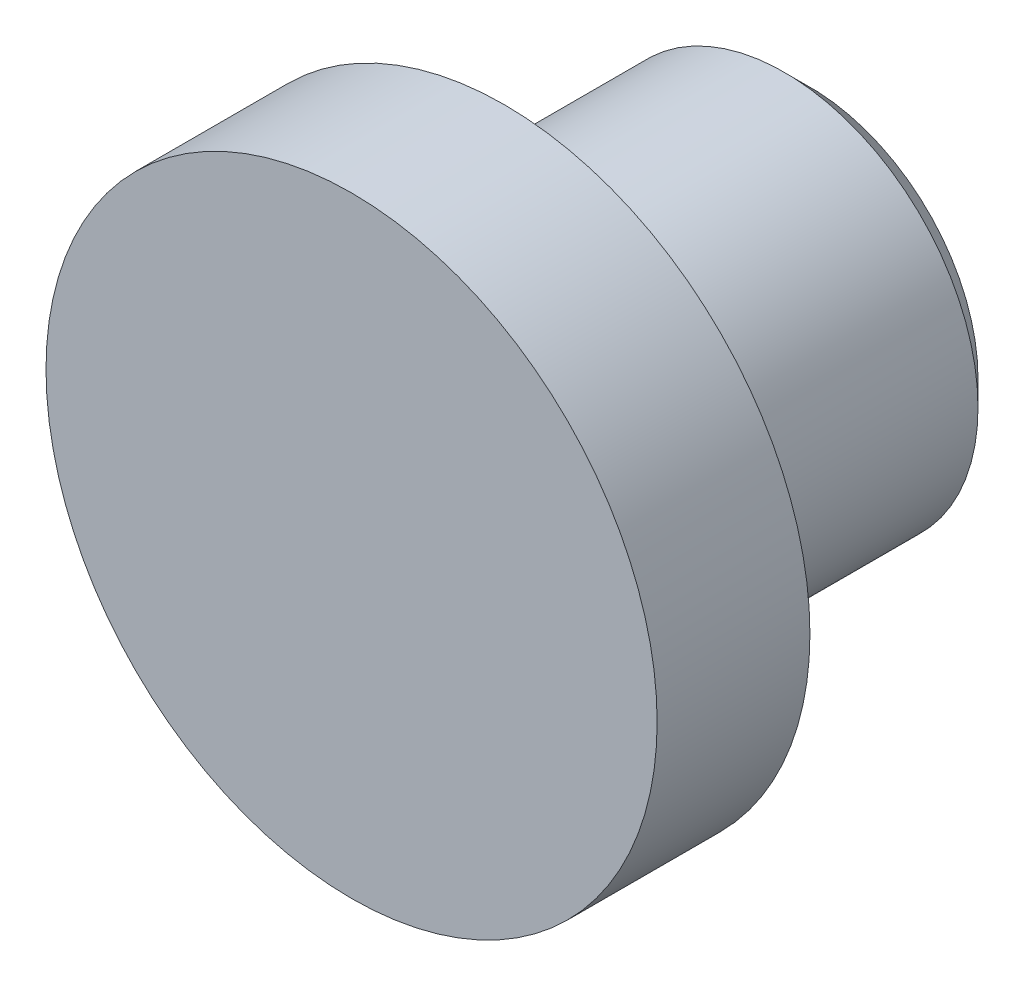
ISO-10303-21;
HEADER;
FILE_DESCRIPTION(('STEP AP214'),'2;1');
FILE_NAME('part.step','',(''),(''),'','','');
FILE_SCHEMA(('AUTOMOTIVE_DESIGN { 1 0 10303 214 1 1 1 1 }'));
ENDSEC;
DATA;
#1=APPLICATION_CONTEXT('core data for automotive mechanical design processes');
#2=APPLICATION_PROTOCOL_DEFINITION('international standard','automotive_design',2000,#1);
#3=PRODUCT_CONTEXT('',#1,'mechanical');
#4=PRODUCT('Part','Part','',(#3));
#5=PRODUCT_RELATED_PRODUCT_CATEGORY('part','',(#4));
#6=PRODUCT_DEFINITION_FORMATION('','',#4);
#7=PRODUCT_DEFINITION_CONTEXT('part definition',#1,'design');
#8=PRODUCT_DEFINITION('design','',#6,#7);
#9=PRODUCT_DEFINITION_SHAPE('','',#8);
#10=(LENGTH_UNIT() NAMED_UNIT(*) SI_UNIT(.MILLI.,.METRE.));
#11=(NAMED_UNIT(*) PLANE_ANGLE_UNIT() SI_UNIT($,.RADIAN.));
#12=(NAMED_UNIT(*) SI_UNIT($,.STERADIAN.) SOLID_ANGLE_UNIT());
#13=UNCERTAINTY_MEASURE_WITH_UNIT(LENGTH_MEASURE(1.E-05),#10,'distance_accuracy_value','');
#14=(GEOMETRIC_REPRESENTATION_CONTEXT(3) GLOBAL_UNCERTAINTY_ASSIGNED_CONTEXT((#13)) GLOBAL_UNIT_ASSIGNED_CONTEXT((#10,
#11,#12)) REPRESENTATION_CONTEXT('',''));
#15=CARTESIAN_POINT('',(0.,0.,0.));
#16=DIRECTION('',(0.,0.,1.));
#17=DIRECTION('',(1.,0.,0.));
#18=AXIS2_PLACEMENT_3D('',#15,#16,#17);
#19=CARTESIAN_POINT('',(0.,0.,6.));
#20=DIRECTION('',(0.,0.,-1.));
#21=DIRECTION('',(-1.,0.,0.));
#22=AXIS2_PLACEMENT_3D('',#19,#20,#21);
#23=CYLINDRICAL_SURFACE('',#22,3.8);
#24=CARTESIAN_POINT('',(0.,0.,0.500000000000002));
#25=DIRECTION('',(0.,0.,1.));
#26=DIRECTION('',(1.,0.,0.));
#27=AXIS2_PLACEMENT_3D('',#24,#25,#26);
#28=CIRCLE('',#27,3.8);
#29=CARTESIAN_POINT('',(3.8,0.,0.500000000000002));
#30=VERTEX_POINT('',#29);
#31=EDGE_CURVE('E45',#30,#30,#28,.T.);
#32=ORIENTED_EDGE('',*,*,#31,.T.);
#33=EDGE_LOOP('',(#32));
#34=FACE_BOUND('',#33,.T.);
#35=CARTESIAN_POINT('',(0.,0.,6.));
#36=DIRECTION('',(0.,0.,1.));
#37=DIRECTION('',(1.,0.,0.));
#38=AXIS2_PLACEMENT_3D('',#35,#36,#37);
#39=CIRCLE('',#38,3.8);
#40=CARTESIAN_POINT('',(3.8,0.,6.));
#41=VERTEX_POINT('',#40);
#42=EDGE_CURVE('E49',#41,#41,#39,.T.);
#43=ORIENTED_EDGE('',*,*,#42,.F.);
#44=EDGE_LOOP('',(#43));
#45=FACE_BOUND('',#44,.T.);
#46=ADVANCED_FACE('F37',(#34,#45),#23,.T.);
#47=CARTESIAN_POINT('',(0.,0.,0.));
#48=DIRECTION('',(0.,0.,1.));
#49=DIRECTION('',(1.,0.,0.));
#50=AXIS2_PLACEMENT_3D('',#47,#48,#49);
#51=PLANE('',#50);
#52=CARTESIAN_POINT('',(0.,0.,0.));
#53=DIRECTION('',(0.,0.,1.));
#54=DIRECTION('',(1.,0.,0.));
#55=AXIS2_PLACEMENT_3D('',#52,#53,#54);
#56=CIRCLE('',#55,3.3);
#57=CARTESIAN_POINT('',(3.3,0.,0.));
#58=VERTEX_POINT('',#57);
#59=EDGE_CURVE('E10',#58,#58,#56,.F.);
#60=ORIENTED_EDGE('',*,*,#59,.T.);
#61=EDGE_LOOP('',(#60));
#62=FACE_BOUND('',#61,.T.);
#63=ADVANCED_FACE('F67',(#62),#51,.F.);
#64=CARTESIAN_POINT('',(0.,0.,9.));
#65=DIRECTION('',(0.,0.,-1.));
#66=DIRECTION('',(-1.,0.,0.));
#67=AXIS2_PLACEMENT_3D('',#64,#65,#66);
#68=CYLINDRICAL_SURFACE('',#67,6.);
#69=CARTESIAN_POINT('',(0.,0.,9.));
#70=DIRECTION('',(0.,0.,1.));
#71=DIRECTION('',(1.,0.,0.));
#72=AXIS2_PLACEMENT_3D('',#69,#70,#71);
#73=CIRCLE('',#72,6.);
#74=CARTESIAN_POINT('',(6.,0.,9.));
#75=VERTEX_POINT('',#74);
#76=EDGE_CURVE('E53',#75,#75,#73,.T.);
#77=ORIENTED_EDGE('',*,*,#76,.F.);
#78=EDGE_LOOP('',(#77));
#79=FACE_BOUND('',#78,.T.);
#80=CARTESIAN_POINT('',(0.,0.,6.));
#81=DIRECTION('',(0.,0.,1.));
#82=DIRECTION('',(1.,0.,0.));
#83=AXIS2_PLACEMENT_3D('',#80,#81,#82);
#84=CIRCLE('',#83,6.);
#85=CARTESIAN_POINT('',(6.,0.,6.));
#86=VERTEX_POINT('',#85);
#87=EDGE_CURVE('E56',#86,#86,#84,.T.);
#88=ORIENTED_EDGE('',*,*,#87,.T.);
#89=EDGE_LOOP('',(#88));
#90=FACE_BOUND('',#89,.T.);
#91=ADVANCED_FACE('F64',(#79,#90),#68,.T.);
#92=CARTESIAN_POINT('',(0.,0.,9.));
#93=DIRECTION('',(0.,0.,1.));
#94=DIRECTION('',(1.,0.,0.));
#95=AXIS2_PLACEMENT_3D('',#92,#93,#94);
#96=PLANE('',#95);
#97=ORIENTED_EDGE('',*,*,#76,.T.);
#98=EDGE_LOOP('',(#97));
#99=FACE_BOUND('',#98,.T.);
#100=ADVANCED_FACE('F62',(#99),#96,.T.);
#101=CARTESIAN_POINT('',(0.,0.,6.));
#102=DIRECTION('',(0.,0.,1.));
#103=DIRECTION('',(1.,0.,0.));
#104=AXIS2_PLACEMENT_3D('',#101,#102,#103);
#105=PLANE('',#104);
#106=ORIENTED_EDGE('',*,*,#42,.T.);
#107=EDGE_LOOP('',(#106));
#108=FACE_BOUND('',#107,.T.);
#109=ORIENTED_EDGE('',*,*,#87,.F.);
#110=EDGE_LOOP('',(#109));
#111=FACE_BOUND('',#110,.T.);
#112=ADVANCED_FACE('F71',(#108,#111),#105,.F.);
#113=CARTESIAN_POINT('',(0.,0.,0.500000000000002));
#114=DIRECTION('',(0.,0.,1.));
#115=DIRECTION('',(1.,0.,0.));
#116=AXIS2_PLACEMENT_3D('',#113,#114,#115);
#117=CONICAL_SURFACE('',#116,3.8,0.78539816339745);
#118=ORIENTED_EDGE('',*,*,#59,.F.);
#119=EDGE_LOOP('',(#118));
#120=FACE_BOUND('',#119,.T.);
#121=ORIENTED_EDGE('',*,*,#31,.F.);
#122=EDGE_LOOP('',(#121));
#123=FACE_BOUND('',#122,.T.);
#124=ADVANCED_FACE('F40',(#120,#123),#117,.T.);
#125=CLOSED_SHELL('',(#46,#63,#91,#100,#112,#124));
#126=MANIFOLD_SOLID_BREP('B2',#125);
#127=ADVANCED_BREP_SHAPE_REPRESENTATION('',(#18,#126),#14);
#128=SHAPE_DEFINITION_REPRESENTATION(#9,#127);
ENDSEC;
END-ISO-10303-21;
